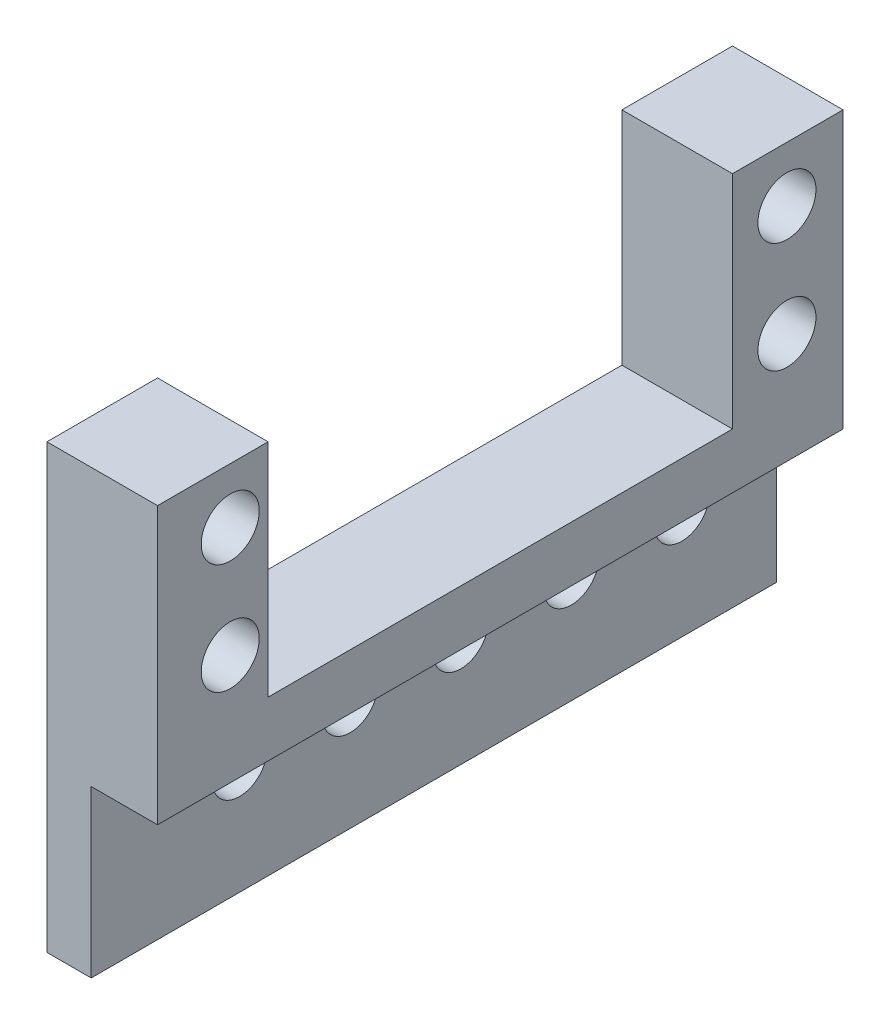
from build123d import *

# Parameters (mm, degrees)
SKETCH2_W           = 10
SKETCH2_H           = 62
BOSS_EXTRUDE1_DEPTH = 5
SKETCH3_W           = 10
SKETCH3_H           = 10
BOSS_EXTRUDE2_DEPTH = 20
SKETCH4_R           = 2.625
CUT_EXTRUDE1_DEPTH  = 10
SKETCH5_W           = 62
SKETCH5_H           = 15
BOSS_EXTRUDE3_DEPTH = 4
SKETCH6_R           = 2.5
CUT_EXTRUDE2_DEPTH  = 4


with BuildPart() as part:
    # Sketch2 → Boss-Extrude1 (new body)
    with BuildSketch(Plane(origin=(0, 0, 0), x_dir=(1, 0, 0), z_dir=(0, 1, 0))):
        with Locations((5, -31)):
            Rectangle(SKETCH2_W, SKETCH2_H)
    extrude(amount=BOSS_EXTRUDE1_DEPTH)

    # Sketch3 → Boss-Extrude2 (add)
    with BuildSketch(Plane(origin=(0, 5, 0), x_dir=(1, 0, 0), z_dir=(0, 1, 0))):
        with Locations((5, -5)):
            Rectangle(SKETCH3_W, SKETCH3_H)
        with Locations((5, -57)):
            Rectangle(SKETCH3_W, SKETCH3_H)
    extrude(amount=BOSS_EXTRUDE2_DEPTH)

    # Sketch4 → Cut-Extrude1 (cut)
    with BuildSketch(Plane(origin=(10, 0, 0), x_dir=(0, 0, -1), z_dir=(1, 0, 0))):
        with Locations((-5.075, 10)):
            Circle(SKETCH4_R)
        with Locations((-5.075, 20)):
            Circle(SKETCH4_R)
        with Locations((-55.425, 20)):
            Circle(SKETCH4_R)
        with Locations((-55.425, 10)):
            Circle(SKETCH4_R)
    extrude(amount=-CUT_EXTRUDE1_DEPTH, mode=Mode.SUBTRACT)

    # Sketch5 → Boss-Extrude3 (add)
    with BuildSketch(Plane.ZY):
        with Locations((31, -7.5)):
            Rectangle(SKETCH5_W, SKETCH5_H)
    extrude(amount=-BOSS_EXTRUDE3_DEPTH)

    # Sketch6 → Cut-Extrude2 (cut)
    with BuildSketch(Plane(origin=(4, 0, 0), x_dir=(0, 0, -1), z_dir=(1, 0, 0))):
        with Locations((-8.579278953, -5)):
            Circle(SKETCH6_R)
        with Locations((-18.579278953, -5)):
            Circle(SKETCH6_R)
        with Locations((-28.579278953, -5)):
            Circle(SKETCH6_R)
        with Locations((-38.579278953, -5)):
            Circle(SKETCH6_R)
        with Locations((-48.579278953, -5)):
            Circle(SKETCH6_R)
    extrude(amount=-CUT_EXTRUDE2_DEPTH, mode=Mode.SUBTRACT)


solid = part.part
